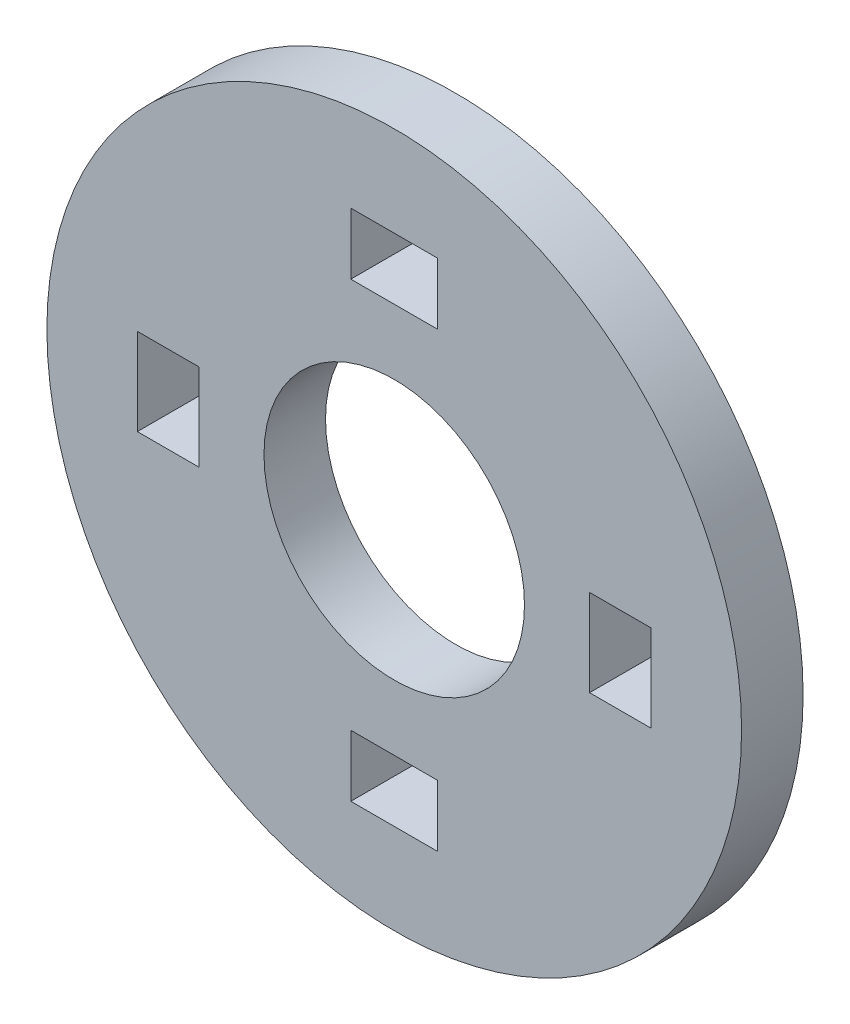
ISO-10303-21;
HEADER;
FILE_DESCRIPTION(('STEP AP214'),'2;1');
FILE_NAME('part.step','',(''),(''),'','','');
FILE_SCHEMA(('AUTOMOTIVE_DESIGN { 1 0 10303 214 1 1 1 1 }'));
ENDSEC;
DATA;
#1=APPLICATION_CONTEXT('core data for automotive mechanical design processes');
#2=APPLICATION_PROTOCOL_DEFINITION('international standard','automotive_design',2000,#1);
#3=PRODUCT_CONTEXT('',#1,'mechanical');
#4=PRODUCT('Part','Part','',(#3));
#5=PRODUCT_RELATED_PRODUCT_CATEGORY('part','',(#4));
#6=PRODUCT_DEFINITION_FORMATION('','',#4);
#7=PRODUCT_DEFINITION_CONTEXT('part definition',#1,'design');
#8=PRODUCT_DEFINITION('design','',#6,#7);
#9=PRODUCT_DEFINITION_SHAPE('','',#8);
#10=(LENGTH_UNIT() NAMED_UNIT(*) SI_UNIT(.MILLI.,.METRE.));
#11=(NAMED_UNIT(*) PLANE_ANGLE_UNIT() SI_UNIT($,.RADIAN.));
#12=(NAMED_UNIT(*) SI_UNIT($,.STERADIAN.) SOLID_ANGLE_UNIT());
#13=UNCERTAINTY_MEASURE_WITH_UNIT(LENGTH_MEASURE(1.E-05),#10,'distance_accuracy_value','');
#14=(GEOMETRIC_REPRESENTATION_CONTEXT(3) GLOBAL_UNCERTAINTY_ASSIGNED_CONTEXT((#13)) GLOBAL_UNIT_ASSIGNED_CONTEXT((#10,
#11,#12)) REPRESENTATION_CONTEXT('',''));
#15=CARTESIAN_POINT('',(0.,0.,0.));
#16=DIRECTION('',(0.,0.,1.));
#17=DIRECTION('',(1.,0.,0.));
#18=AXIS2_PLACEMENT_3D('',#15,#16,#17);
#19=CARTESIAN_POINT('',(0.,0.,4.5));
#20=DIRECTION('',(0.,0.,1.));
#21=DIRECTION('',(1.,0.,0.));
#22=AXIS2_PLACEMENT_3D('',#19,#20,#21);
#23=PLANE('',#22);
#24=CARTESIAN_POINT('',(0.,0.,4.5));
#25=DIRECTION('',(0.,0.,1.));
#26=DIRECTION('',(1.,0.,0.));
#27=AXIS2_PLACEMENT_3D('',#24,#25,#26);
#28=CIRCLE('',#27,9.525);
#29=CARTESIAN_POINT('',(9.525,0.,4.5));
#30=VERTEX_POINT('',#29);
#31=EDGE_CURVE('E169',#30,#30,#28,.T.);
#32=ORIENTED_EDGE('',*,*,#31,.F.);
#33=EDGE_LOOP('',(#32));
#34=FACE_BOUND('',#33,.T.);
#35=DIRECTION('',(0.,-1.,0.));
#36=VECTOR('',#35,1.);
#37=CARTESIAN_POINT('',(-3.175,0.,4.5));
#38=LINE('',#37,#36);
#39=CARTESIAN_POINT('',(-3.175,18.7835533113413,4.5));
#40=VERTEX_POINT('',#39);
#41=CARTESIAN_POINT('',(-3.175,14.2835533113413,4.5));
#42=VERTEX_POINT('',#41);
#43=EDGE_CURVE('E210',#40,#42,#38,.T.);
#44=ORIENTED_EDGE('',*,*,#43,.F.);
#45=DIRECTION('',(1.,0.,0.));
#46=VECTOR('',#45,1.);
#47=CARTESIAN_POINT('',(0.,18.7835533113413,4.5));
#48=LINE('',#47,#46);
#49=CARTESIAN_POINT('',(3.175,18.7835533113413,4.5));
#50=VERTEX_POINT('',#49);
#51=EDGE_CURVE('E221',#40,#50,#48,.T.);
#52=ORIENTED_EDGE('',*,*,#51,.T.);
#53=DIRECTION('',(0.,-1.,0.));
#54=VECTOR('',#53,1.);
#55=CARTESIAN_POINT('',(3.175,0.,4.5));
#56=LINE('',#55,#54);
#57=CARTESIAN_POINT('',(3.175,14.2835533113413,4.5));
#58=VERTEX_POINT('',#57);
#59=EDGE_CURVE('E234',#50,#58,#56,.T.);
#60=ORIENTED_EDGE('',*,*,#59,.T.);
#61=DIRECTION('',(1.,0.,0.));
#62=VECTOR('',#61,1.);
#63=CARTESIAN_POINT('',(0.,14.2835533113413,4.5));
#64=LINE('',#63,#62);
#65=EDGE_CURVE('E231',#42,#58,#64,.T.);
#66=ORIENTED_EDGE('',*,*,#65,.F.);
#67=EDGE_LOOP('',(#44,#52,#60,#66));
#68=FACE_BOUND('',#67,.T.);
#69=CARTESIAN_POINT('',(0.,0.,4.5));
#70=DIRECTION('',(0.,0.,1.));
#71=DIRECTION('',(1.,0.,0.));
#72=AXIS2_PLACEMENT_3D('',#69,#70,#71);
#73=CIRCLE('',#72,25.4);
#74=CARTESIAN_POINT('',(25.4,0.,4.5));
#75=VERTEX_POINT('',#74);
#76=EDGE_CURVE('E11',#75,#75,#73,.T.);
#77=ORIENTED_EDGE('',*,*,#76,.T.);
#78=EDGE_LOOP('',(#77));
#79=FACE_BOUND('',#78,.T.);
#80=DIRECTION('',(0.,1.,0.));
#81=VECTOR('',#80,1.);
#82=CARTESIAN_POINT('',(-18.7835533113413,2.05255249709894E-13,4.5));
#83=LINE('',#82,#81);
#84=CARTESIAN_POINT('',(-18.7835533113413,-3.17499999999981,4.5));
#85=VERTEX_POINT('',#84);
#86=CARTESIAN_POINT('',(-18.7835533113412,3.17500000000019,4.5));
#87=VERTEX_POINT('',#86);
#88=EDGE_CURVE('E262',#85,#87,#83,.T.);
#89=ORIENTED_EDGE('',*,*,#88,.T.);
#90=DIRECTION('',(1.,0.,0.));
#91=VECTOR('',#90,1.);
#92=CARTESIAN_POINT('',(0.,3.175,4.5));
#93=LINE('',#92,#91);
#94=CARTESIAN_POINT('',(-14.2835533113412,3.17500000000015,4.5));
#95=VERTEX_POINT('',#94);
#96=EDGE_CURVE('E241',#87,#95,#93,.T.);
#97=ORIENTED_EDGE('',*,*,#96,.T.);
#98=DIRECTION('',(0.,1.,0.));
#99=VECTOR('',#98,1.);
#100=CARTESIAN_POINT('',(-14.2835533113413,1.4827788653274E-13,4.5));
#101=LINE('',#100,#99);
#102=CARTESIAN_POINT('',(-14.2835533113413,-3.17499999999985,4.5));
#103=VERTEX_POINT('',#102);
#104=EDGE_CURVE('E251',#103,#95,#101,.T.);
#105=ORIENTED_EDGE('',*,*,#104,.F.);
#106=DIRECTION('',(1.,0.,0.));
#107=VECTOR('',#106,1.);
#108=CARTESIAN_POINT('',(0.,-3.175,4.5));
#109=LINE('',#108,#107);
#110=EDGE_CURVE('E265',#85,#103,#109,.T.);
#111=ORIENTED_EDGE('',*,*,#110,.F.);
#112=EDGE_LOOP('',(#89,#97,#105,#111));
#113=FACE_BOUND('',#112,.T.);
#114=DIRECTION('',(0.,-1.,0.));
#115=VECTOR('',#114,1.);
#116=CARTESIAN_POINT('',(18.7835533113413,0.,4.5));
#117=LINE('',#116,#115);
#118=CARTESIAN_POINT('',(18.7835533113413,3.17499999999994,4.5));
#119=VERTEX_POINT('',#118);
#120=CARTESIAN_POINT('',(18.7835533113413,-3.17500000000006,4.5));
#121=VERTEX_POINT('',#120);
#122=EDGE_CURVE('E200',#119,#121,#117,.T.);
#123=ORIENTED_EDGE('',*,*,#122,.T.);
#124=DIRECTION('',(-1.,0.,0.));
#125=VECTOR('',#124,1.);
#126=CARTESIAN_POINT('',(0.,-3.175,4.5));
#127=LINE('',#126,#125);
#128=CARTESIAN_POINT('',(14.2835533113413,-3.17500000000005,4.5));
#129=VERTEX_POINT('',#128);
#130=EDGE_CURVE('E182',#121,#129,#127,.T.);
#131=ORIENTED_EDGE('',*,*,#130,.T.);
#132=DIRECTION('',(0.,-1.,0.));
#133=VECTOR('',#132,1.);
#134=CARTESIAN_POINT('',(14.2835533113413,0.,4.5));
#135=LINE('',#134,#133);
#136=CARTESIAN_POINT('',(14.2835533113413,3.17499999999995,4.5));
#137=VERTEX_POINT('',#136);
#138=EDGE_CURVE('E189',#137,#129,#135,.T.);
#139=ORIENTED_EDGE('',*,*,#138,.F.);
#140=DIRECTION('',(-1.,0.,0.));
#141=VECTOR('',#140,1.);
#142=CARTESIAN_POINT('',(0.,3.175,4.5));
#143=LINE('',#142,#141);
#144=EDGE_CURVE('E203',#119,#137,#143,.T.);
#145=ORIENTED_EDGE('',*,*,#144,.F.);
#146=EDGE_LOOP('',(#123,#131,#139,#145));
#147=FACE_BOUND('',#146,.T.);
#148=DIRECTION('',(-1.,0.,0.));
#149=VECTOR('',#148,1.);
#150=CARTESIAN_POINT('',(-1.23153149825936E-13,-18.7835533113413,4.5));
#151=LINE('',#150,#149);
#152=CARTESIAN_POINT('',(3.17499999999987,-18.7835533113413,4.5));
#153=VERTEX_POINT('',#152);
#154=CARTESIAN_POINT('',(-3.17500000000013,-18.7835533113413,4.5));
#155=VERTEX_POINT('',#154);
#156=EDGE_CURVE('E175',#153,#155,#151,.T.);
#157=ORIENTED_EDGE('',*,*,#156,.T.);
#158=DIRECTION('',(0.,1.,0.));
#159=VECTOR('',#158,1.);
#160=CARTESIAN_POINT('',(-3.175,0.,4.5));
#161=LINE('',#160,#159);
#162=CARTESIAN_POINT('',(-3.1750000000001,-14.2835533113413,4.5));
#163=VERTEX_POINT('',#162);
#164=EDGE_CURVE('E48',#155,#163,#161,.T.);
#165=ORIENTED_EDGE('',*,*,#164,.T.);
#166=DIRECTION('',(-1.,0.,0.));
#167=VECTOR('',#166,1.);
#168=CARTESIAN_POINT('',(-1.01453290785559E-13,-14.2835533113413,4.5));
#169=LINE('',#168,#167);
#170=CARTESIAN_POINT('',(3.1749999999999,-14.2835533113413,4.5));
#171=VERTEX_POINT('',#170);
#172=EDGE_CURVE('E163',#171,#163,#169,.T.);
#173=ORIENTED_EDGE('',*,*,#172,.F.);
#174=DIRECTION('',(0.,1.,0.));
#175=VECTOR('',#174,1.);
#176=CARTESIAN_POINT('',(3.175,0.,4.5));
#177=LINE('',#176,#175);
#178=EDGE_CURVE('E166',#153,#171,#177,.T.);
#179=ORIENTED_EDGE('',*,*,#178,.F.);
#180=EDGE_LOOP('',(#157,#165,#173,#179));
#181=FACE_BOUND('',#180,.T.);
#182=ADVANCED_FACE('F33',(#34,#68,#79,#113,#147,#181),#23,.T.);
#183=CARTESIAN_POINT('',(0.,0.,0.));
#184=DIRECTION('',(0.,0.,1.));
#185=DIRECTION('',(1.,0.,0.));
#186=AXIS2_PLACEMENT_3D('',#183,#184,#185);
#187=PLANE('',#186);
#188=CARTESIAN_POINT('',(0.,0.,0.));
#189=DIRECTION('',(0.,0.,1.));
#190=DIRECTION('',(1.,0.,0.));
#191=AXIS2_PLACEMENT_3D('',#188,#189,#190);
#192=CIRCLE('',#191,9.525);
#193=CARTESIAN_POINT('',(9.525,0.,0.));
#194=VERTEX_POINT('',#193);
#195=EDGE_CURVE('E176',#194,#194,#192,.T.);
#196=ORIENTED_EDGE('',*,*,#195,.T.);
#197=EDGE_LOOP('',(#196));
#198=FACE_BOUND('',#197,.T.);
#199=DIRECTION('',(-1.,0.,0.));
#200=VECTOR('',#199,1.);
#201=CARTESIAN_POINT('',(0.,-3.175,0.));
#202=LINE('',#201,#200);
#203=CARTESIAN_POINT('',(18.7835533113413,-3.17500000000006,0.));
#204=VERTEX_POINT('',#203);
#205=CARTESIAN_POINT('',(14.2835533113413,-3.17500000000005,0.));
#206=VERTEX_POINT('',#205);
#207=EDGE_CURVE('E186',#204,#206,#202,.T.);
#208=ORIENTED_EDGE('',*,*,#207,.F.);
#209=DIRECTION('',(0.,-1.,0.));
#210=VECTOR('',#209,1.);
#211=CARTESIAN_POINT('',(18.7835533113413,0.,0.));
#212=LINE('',#211,#210);
#213=CARTESIAN_POINT('',(18.7835533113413,3.17499999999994,0.));
#214=VERTEX_POINT('',#213);
#215=EDGE_CURVE('E188',#214,#204,#212,.T.);
#216=ORIENTED_EDGE('',*,*,#215,.F.);
#217=DIRECTION('',(-1.,0.,0.));
#218=VECTOR('',#217,1.);
#219=CARTESIAN_POINT('',(0.,3.175,0.));
#220=LINE('',#219,#218);
#221=CARTESIAN_POINT('',(14.2835533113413,3.17499999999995,0.));
#222=VERTEX_POINT('',#221);
#223=EDGE_CURVE('E191',#214,#222,#220,.T.);
#224=ORIENTED_EDGE('',*,*,#223,.T.);
#225=DIRECTION('',(0.,-1.,0.));
#226=VECTOR('',#225,1.);
#227=CARTESIAN_POINT('',(14.2835533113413,0.,0.));
#228=LINE('',#227,#226);
#229=EDGE_CURVE('E194',#222,#206,#228,.T.);
#230=ORIENTED_EDGE('',*,*,#229,.T.);
#231=EDGE_LOOP('',(#208,#216,#224,#230));
#232=FACE_BOUND('',#231,.T.);
#233=DIRECTION('',(1.,0.,0.));
#234=VECTOR('',#233,1.);
#235=CARTESIAN_POINT('',(0.,18.7835533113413,0.));
#236=LINE('',#235,#234);
#237=CARTESIAN_POINT('',(-3.175,18.7835533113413,0.));
#238=VERTEX_POINT('',#237);
#239=CARTESIAN_POINT('',(3.175,18.7835533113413,0.));
#240=VERTEX_POINT('',#239);
#241=EDGE_CURVE('E227',#238,#240,#236,.T.);
#242=ORIENTED_EDGE('',*,*,#241,.F.);
#243=DIRECTION('',(0.,-1.,0.));
#244=VECTOR('',#243,1.);
#245=CARTESIAN_POINT('',(-3.175,0.,0.));
#246=LINE('',#245,#244);
#247=CARTESIAN_POINT('',(-3.175,14.2835533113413,0.));
#248=VERTEX_POINT('',#247);
#249=EDGE_CURVE('E217',#238,#248,#246,.T.);
#250=ORIENTED_EDGE('',*,*,#249,.T.);
#251=DIRECTION('',(1.,0.,0.));
#252=VECTOR('',#251,1.);
#253=CARTESIAN_POINT('',(0.,14.2835533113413,0.));
#254=LINE('',#253,#252);
#255=CARTESIAN_POINT('',(3.175,14.2835533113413,0.));
#256=VERTEX_POINT('',#255);
#257=EDGE_CURVE('E220',#248,#256,#254,.T.);
#258=ORIENTED_EDGE('',*,*,#257,.T.);
#259=DIRECTION('',(0.,-1.,0.));
#260=VECTOR('',#259,1.);
#261=CARTESIAN_POINT('',(3.175,0.,0.));
#262=LINE('',#261,#260);
#263=EDGE_CURVE('E224',#240,#256,#262,.T.);
#264=ORIENTED_EDGE('',*,*,#263,.F.);
#265=EDGE_LOOP('',(#242,#250,#258,#264));
#266=FACE_BOUND('',#265,.T.);
#267=CARTESIAN_POINT('',(0.,0.,0.));
#268=DIRECTION('',(0.,0.,1.));
#269=DIRECTION('',(1.,0.,0.));
#270=AXIS2_PLACEMENT_3D('',#267,#268,#269);
#271=CIRCLE('',#270,25.4);
#272=CARTESIAN_POINT('',(25.4,0.,0.));
#273=VERTEX_POINT('',#272);
#274=EDGE_CURVE('E37',#273,#273,#271,.T.);
#275=ORIENTED_EDGE('',*,*,#274,.F.);
#276=EDGE_LOOP('',(#275));
#277=FACE_BOUND('',#276,.T.);
#278=DIRECTION('',(1.,0.,0.));
#279=VECTOR('',#278,1.);
#280=CARTESIAN_POINT('',(0.,3.175,0.));
#281=LINE('',#280,#279);
#282=CARTESIAN_POINT('',(-18.7835533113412,3.17500000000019,0.));
#283=VERTEX_POINT('',#282);
#284=CARTESIAN_POINT('',(-14.2835533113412,3.17500000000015,0.));
#285=VERTEX_POINT('',#284);
#286=EDGE_CURVE('E248',#283,#285,#281,.T.);
#287=ORIENTED_EDGE('',*,*,#286,.F.);
#288=DIRECTION('',(0.,1.,0.));
#289=VECTOR('',#288,1.);
#290=CARTESIAN_POINT('',(-18.7835533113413,2.05255249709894E-13,0.));
#291=LINE('',#290,#289);
#292=CARTESIAN_POINT('',(-18.7835533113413,-3.17499999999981,0.));
#293=VERTEX_POINT('',#292);
#294=EDGE_CURVE('E250',#293,#283,#291,.T.);
#295=ORIENTED_EDGE('',*,*,#294,.F.);
#296=DIRECTION('',(1.,0.,0.));
#297=VECTOR('',#296,1.);
#298=CARTESIAN_POINT('',(0.,-3.175,0.));
#299=LINE('',#298,#297);
#300=CARTESIAN_POINT('',(-14.2835533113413,-3.17499999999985,0.));
#301=VERTEX_POINT('',#300);
#302=EDGE_CURVE('E253',#293,#301,#299,.T.);
#303=ORIENTED_EDGE('',*,*,#302,.T.);
#304=DIRECTION('',(0.,1.,0.));
#305=VECTOR('',#304,1.);
#306=CARTESIAN_POINT('',(-14.2835533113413,1.4827788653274E-13,0.));
#307=LINE('',#306,#305);
#308=EDGE_CURVE('E256',#301,#285,#307,.T.);
#309=ORIENTED_EDGE('',*,*,#308,.T.);
#310=EDGE_LOOP('',(#287,#295,#303,#309));
#311=FACE_BOUND('',#310,.T.);
#312=DIRECTION('',(0.,1.,0.));
#313=VECTOR('',#312,1.);
#314=CARTESIAN_POINT('',(-3.175,0.,0.));
#315=LINE('',#314,#313);
#316=CARTESIAN_POINT('',(-3.17500000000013,-18.7835533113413,0.));
#317=VERTEX_POINT('',#316);
#318=CARTESIAN_POINT('',(-3.1750000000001,-14.2835533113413,0.));
#319=VERTEX_POINT('',#318);
#320=EDGE_CURVE('E154',#317,#319,#315,.T.);
#321=ORIENTED_EDGE('',*,*,#320,.F.);
#322=DIRECTION('',(-1.,0.,0.));
#323=VECTOR('',#322,1.);
#324=CARTESIAN_POINT('',(-1.23153149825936E-13,-18.7835533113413,0.));
#325=LINE('',#324,#323);
#326=CARTESIAN_POINT('',(3.17499999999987,-18.7835533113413,0.));
#327=VERTEX_POINT('',#326);
#328=EDGE_CURVE('E146',#327,#317,#325,.T.);
#329=ORIENTED_EDGE('',*,*,#328,.F.);
#330=DIRECTION('',(0.,1.,0.));
#331=VECTOR('',#330,1.);
#332=CARTESIAN_POINT('',(3.175,0.,0.));
#333=LINE('',#332,#331);
#334=CARTESIAN_POINT('',(3.1749999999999,-14.2835533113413,0.));
#335=VERTEX_POINT('',#334);
#336=EDGE_CURVE('E56',#327,#335,#333,.T.);
#337=ORIENTED_EDGE('',*,*,#336,.T.);
#338=DIRECTION('',(-1.,0.,0.));
#339=VECTOR('',#338,1.);
#340=CARTESIAN_POINT('',(-1.01453290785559E-13,-14.2835533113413,0.));
#341=LINE('',#340,#339);
#342=EDGE_CURVE('E158',#335,#319,#341,.T.);
#343=ORIENTED_EDGE('',*,*,#342,.T.);
#344=EDGE_LOOP('',(#321,#329,#337,#343));
#345=FACE_BOUND('',#344,.T.);
#346=ADVANCED_FACE('F161',(#198,#232,#266,#277,#311,#345),#187,.F.);
#347=CARTESIAN_POINT('',(0.,0.,4.5));
#348=DIRECTION('',(0.,0.,-1.));
#349=DIRECTION('',(-1.,0.,0.));
#350=AXIS2_PLACEMENT_3D('',#347,#348,#349);
#351=CYLINDRICAL_SURFACE('',#350,25.4);
#352=ORIENTED_EDGE('',*,*,#76,.F.);
#353=EDGE_LOOP('',(#352));
#354=FACE_BOUND('',#353,.T.);
#355=ORIENTED_EDGE('',*,*,#274,.T.);
#356=EDGE_LOOP('',(#355));
#357=FACE_BOUND('',#356,.T.);
#358=ADVANCED_FACE('F35',(#354,#357),#351,.T.);
#359=CARTESIAN_POINT('',(0.,3.175,0.));
#360=DIRECTION('',(0.,-1.,0.));
#361=DIRECTION('',(1.,0.,0.));
#362=AXIS2_PLACEMENT_3D('',#359,#360,#361);
#363=PLANE('',#362);
#364=ORIENTED_EDGE('',*,*,#96,.F.);
#365=DIRECTION('',(0.,0.,1.));
#366=VECTOR('',#365,1.);
#367=CARTESIAN_POINT('',(-18.7835533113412,3.17500000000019,0.));
#368=LINE('',#367,#366);
#369=EDGE_CURVE('E259',#283,#87,#368,.T.);
#370=ORIENTED_EDGE('',*,*,#369,.F.);
#371=ORIENTED_EDGE('',*,*,#286,.T.);
#372=DIRECTION('',(0.,0.,1.));
#373=VECTOR('',#372,1.);
#374=CARTESIAN_POINT('',(-14.2835533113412,3.17500000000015,0.));
#375=LINE('',#374,#373);
#376=EDGE_CURVE('E270',#285,#95,#375,.T.);
#377=ORIENTED_EDGE('',*,*,#376,.T.);
#378=EDGE_LOOP('',(#364,#370,#371,#377));
#379=FACE_BOUND('',#378,.T.);
#380=ADVANCED_FACE('F294',(#379),#363,.T.);
#381=CARTESIAN_POINT('',(-14.2835533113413,1.4827788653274E-13,0.));
#382=DIRECTION('',(1.,0.,0.));
#383=DIRECTION('',(0.,1.,0.));
#384=AXIS2_PLACEMENT_3D('',#381,#382,#383);
#385=PLANE('',#384);
#386=ORIENTED_EDGE('',*,*,#104,.T.);
#387=ORIENTED_EDGE('',*,*,#376,.F.);
#388=ORIENTED_EDGE('',*,*,#308,.F.);
#389=DIRECTION('',(0.,0.,1.));
#390=VECTOR('',#389,1.);
#391=CARTESIAN_POINT('',(-14.2835533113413,-3.17499999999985,0.));
#392=LINE('',#391,#390);
#393=EDGE_CURVE('E272',#301,#103,#392,.T.);
#394=ORIENTED_EDGE('',*,*,#393,.T.);
#395=EDGE_LOOP('',(#386,#387,#388,#394));
#396=FACE_BOUND('',#395,.T.);
#397=ADVANCED_FACE('F296',(#396),#385,.F.);
#398=CARTESIAN_POINT('',(0.,-3.175,0.));
#399=DIRECTION('',(0.,-1.,0.));
#400=DIRECTION('',(1.,0.,0.));
#401=AXIS2_PLACEMENT_3D('',#398,#399,#400);
#402=PLANE('',#401);
#403=ORIENTED_EDGE('',*,*,#110,.T.);
#404=ORIENTED_EDGE('',*,*,#393,.F.);
#405=ORIENTED_EDGE('',*,*,#302,.F.);
#406=DIRECTION('',(0.,0.,1.));
#407=VECTOR('',#406,1.);
#408=CARTESIAN_POINT('',(-18.7835533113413,-3.17499999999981,0.));
#409=LINE('',#408,#407);
#410=EDGE_CURVE('E274',#293,#85,#409,.T.);
#411=ORIENTED_EDGE('',*,*,#410,.T.);
#412=EDGE_LOOP('',(#403,#404,#405,#411));
#413=FACE_BOUND('',#412,.T.);
#414=ADVANCED_FACE('F290',(#413),#402,.F.);
#415=CARTESIAN_POINT('',(-18.7835533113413,2.05255249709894E-13,0.));
#416=DIRECTION('',(1.,0.,0.));
#417=DIRECTION('',(0.,1.,0.));
#418=AXIS2_PLACEMENT_3D('',#415,#416,#417);
#419=PLANE('',#418);
#420=ORIENTED_EDGE('',*,*,#88,.F.);
#421=ORIENTED_EDGE('',*,*,#410,.F.);
#422=ORIENTED_EDGE('',*,*,#294,.T.);
#423=ORIENTED_EDGE('',*,*,#369,.T.);
#424=EDGE_LOOP('',(#420,#421,#422,#423));
#425=FACE_BOUND('',#424,.T.);
#426=ADVANCED_FACE('F280',(#425),#419,.T.);
#427=CARTESIAN_POINT('',(-3.175,0.,0.));
#428=DIRECTION('',(-1.,0.,0.));
#429=DIRECTION('',(0.,-1.,0.));
#430=AXIS2_PLACEMENT_3D('',#427,#428,#429);
#431=PLANE('',#430);
#432=ORIENTED_EDGE('',*,*,#43,.T.);
#433=DIRECTION('',(0.,0.,1.));
#434=VECTOR('',#433,1.);
#435=CARTESIAN_POINT('',(-3.175,14.2835533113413,0.));
#436=LINE('',#435,#434);
#437=EDGE_CURVE('E229',#248,#42,#436,.T.);
#438=ORIENTED_EDGE('',*,*,#437,.F.);
#439=ORIENTED_EDGE('',*,*,#249,.F.);
#440=DIRECTION('',(0.,0.,1.));
#441=VECTOR('',#440,1.);
#442=CARTESIAN_POINT('',(-3.175,18.7835533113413,0.));
#443=LINE('',#442,#441);
#444=EDGE_CURVE('E239',#238,#40,#443,.T.);
#445=ORIENTED_EDGE('',*,*,#444,.T.);
#446=EDGE_LOOP('',(#432,#438,#439,#445));
#447=FACE_BOUND('',#446,.T.);
#448=ADVANCED_FACE('F318',(#447),#431,.F.);
#449=CARTESIAN_POINT('',(0.,18.7835533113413,0.));
#450=DIRECTION('',(0.,-1.,0.));
#451=DIRECTION('',(0.,0.,-1.));
#452=AXIS2_PLACEMENT_3D('',#449,#450,#451);
#453=PLANE('',#452);
#454=ORIENTED_EDGE('',*,*,#51,.F.);
#455=ORIENTED_EDGE('',*,*,#444,.F.);
#456=ORIENTED_EDGE('',*,*,#241,.T.);
#457=DIRECTION('',(0.,0.,1.));
#458=VECTOR('',#457,1.);
#459=CARTESIAN_POINT('',(3.175,18.7835533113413,0.));
#460=LINE('',#459,#458);
#461=EDGE_CURVE('E242',#240,#50,#460,.T.);
#462=ORIENTED_EDGE('',*,*,#461,.T.);
#463=EDGE_LOOP('',(#454,#455,#456,#462));
#464=FACE_BOUND('',#463,.T.);
#465=ADVANCED_FACE('F322',(#464),#453,.T.);
#466=CARTESIAN_POINT('',(3.175,0.,0.));
#467=DIRECTION('',(-1.,0.,0.));
#468=DIRECTION('',(0.,-1.,0.));
#469=AXIS2_PLACEMENT_3D('',#466,#467,#468);
#470=PLANE('',#469);
#471=ORIENTED_EDGE('',*,*,#59,.F.);
#472=ORIENTED_EDGE('',*,*,#461,.F.);
#473=ORIENTED_EDGE('',*,*,#263,.T.);
#474=DIRECTION('',(0.,0.,1.));
#475=VECTOR('',#474,1.);
#476=CARTESIAN_POINT('',(3.175,14.2835533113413,0.));
#477=LINE('',#476,#475);
#478=EDGE_CURVE('E244',#256,#58,#477,.T.);
#479=ORIENTED_EDGE('',*,*,#478,.T.);
#480=EDGE_LOOP('',(#471,#472,#473,#479));
#481=FACE_BOUND('',#480,.T.);
#482=ADVANCED_FACE('F327',(#481),#470,.T.);
#483=CARTESIAN_POINT('',(0.,14.2835533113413,0.));
#484=DIRECTION('',(0.,-1.,0.));
#485=DIRECTION('',(0.,0.,-1.));
#486=AXIS2_PLACEMENT_3D('',#483,#484,#485);
#487=PLANE('',#486);
#488=ORIENTED_EDGE('',*,*,#65,.T.);
#489=ORIENTED_EDGE('',*,*,#478,.F.);
#490=ORIENTED_EDGE('',*,*,#257,.F.);
#491=ORIENTED_EDGE('',*,*,#437,.T.);
#492=EDGE_LOOP('',(#488,#489,#490,#491));
#493=FACE_BOUND('',#492,.T.);
#494=ADVANCED_FACE('F331',(#493),#487,.F.);
#495=CARTESIAN_POINT('',(0.,-3.175,0.));
#496=DIRECTION('',(0.,1.,0.));
#497=DIRECTION('',(-1.,0.,0.));
#498=AXIS2_PLACEMENT_3D('',#495,#496,#497);
#499=PLANE('',#498);
#500=ORIENTED_EDGE('',*,*,#130,.F.);
#501=DIRECTION('',(0.,0.,1.));
#502=VECTOR('',#501,1.);
#503=CARTESIAN_POINT('',(18.7835533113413,-3.17500000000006,0.));
#504=LINE('',#503,#502);
#505=EDGE_CURVE('E197',#204,#121,#504,.T.);
#506=ORIENTED_EDGE('',*,*,#505,.F.);
#507=ORIENTED_EDGE('',*,*,#207,.T.);
#508=DIRECTION('',(0.,0.,1.));
#509=VECTOR('',#508,1.);
#510=CARTESIAN_POINT('',(14.2835533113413,-3.17500000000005,0.));
#511=LINE('',#510,#509);
#512=EDGE_CURVE('E208',#206,#129,#511,.T.);
#513=ORIENTED_EDGE('',*,*,#512,.T.);
#514=EDGE_LOOP('',(#500,#506,#507,#513));
#515=FACE_BOUND('',#514,.T.);
#516=ADVANCED_FACE('F334',(#515),#499,.T.);
#517=CARTESIAN_POINT('',(14.2835533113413,0.,0.));
#518=DIRECTION('',(-1.,0.,0.));
#519=DIRECTION('',(0.,-1.,0.));
#520=AXIS2_PLACEMENT_3D('',#517,#518,#519);
#521=PLANE('',#520);
#522=ORIENTED_EDGE('',*,*,#138,.T.);
#523=ORIENTED_EDGE('',*,*,#512,.F.);
#524=ORIENTED_EDGE('',*,*,#229,.F.);
#525=DIRECTION('',(0.,0.,1.));
#526=VECTOR('',#525,1.);
#527=CARTESIAN_POINT('',(14.2835533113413,3.17499999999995,0.));
#528=LINE('',#527,#526);
#529=EDGE_CURVE('E211',#222,#137,#528,.T.);
#530=ORIENTED_EDGE('',*,*,#529,.T.);
#531=EDGE_LOOP('',(#522,#523,#524,#530));
#532=FACE_BOUND('',#531,.T.);
#533=ADVANCED_FACE('F341',(#532),#521,.F.);
#534=CARTESIAN_POINT('',(0.,3.175,0.));
#535=DIRECTION('',(0.,1.,0.));
#536=DIRECTION('',(-1.,0.,0.));
#537=AXIS2_PLACEMENT_3D('',#534,#535,#536);
#538=PLANE('',#537);
#539=ORIENTED_EDGE('',*,*,#144,.T.);
#540=ORIENTED_EDGE('',*,*,#529,.F.);
#541=ORIENTED_EDGE('',*,*,#223,.F.);
#542=DIRECTION('',(0.,0.,1.));
#543=VECTOR('',#542,1.);
#544=CARTESIAN_POINT('',(18.7835533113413,3.17499999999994,0.));
#545=LINE('',#544,#543);
#546=EDGE_CURVE('E213',#214,#119,#545,.T.);
#547=ORIENTED_EDGE('',*,*,#546,.T.);
#548=EDGE_LOOP('',(#539,#540,#541,#547));
#549=FACE_BOUND('',#548,.T.);
#550=ADVANCED_FACE('F346',(#549),#538,.F.);
#551=CARTESIAN_POINT('',(18.7835533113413,0.,0.));
#552=DIRECTION('',(-1.,0.,0.));
#553=DIRECTION('',(0.,-1.,0.));
#554=AXIS2_PLACEMENT_3D('',#551,#552,#553);
#555=PLANE('',#554);
#556=ORIENTED_EDGE('',*,*,#122,.F.);
#557=ORIENTED_EDGE('',*,*,#546,.F.);
#558=ORIENTED_EDGE('',*,*,#215,.T.);
#559=ORIENTED_EDGE('',*,*,#505,.T.);
#560=EDGE_LOOP('',(#556,#557,#558,#559));
#561=FACE_BOUND('',#560,.T.);
#562=ADVANCED_FACE('F343',(#561),#555,.T.);
#563=CARTESIAN_POINT('',(-3.175,0.,0.));
#564=DIRECTION('',(1.,0.,0.));
#565=DIRECTION('',(0.,1.,0.));
#566=AXIS2_PLACEMENT_3D('',#563,#564,#565);
#567=PLANE('',#566);
#568=ORIENTED_EDGE('',*,*,#164,.F.);
#569=DIRECTION('',(0.,0.,1.));
#570=VECTOR('',#569,1.);
#571=CARTESIAN_POINT('',(-3.17500000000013,-18.7835533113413,0.));
#572=LINE('',#571,#570);
#573=EDGE_CURVE('E149',#317,#155,#572,.T.);
#574=ORIENTED_EDGE('',*,*,#573,.F.);
#575=ORIENTED_EDGE('',*,*,#320,.T.);
#576=DIRECTION('',(0.,0.,1.));
#577=VECTOR('',#576,1.);
#578=CARTESIAN_POINT('',(-3.1750000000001,-14.2835533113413,0.));
#579=LINE('',#578,#577);
#580=EDGE_CURVE('E180',#319,#163,#579,.T.);
#581=ORIENTED_EDGE('',*,*,#580,.T.);
#582=EDGE_LOOP('',(#568,#574,#575,#581));
#583=FACE_BOUND('',#582,.T.);
#584=ADVANCED_FACE('F156',(#583),#567,.T.);
#585=CARTESIAN_POINT('',(-1.01453290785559E-13,-14.2835533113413,0.));
#586=DIRECTION('',(0.,1.,0.));
#587=DIRECTION('',(-1.,0.,0.));
#588=AXIS2_PLACEMENT_3D('',#585,#586,#587);
#589=PLANE('',#588);
#590=ORIENTED_EDGE('',*,*,#172,.T.);
#591=ORIENTED_EDGE('',*,*,#580,.F.);
#592=ORIENTED_EDGE('',*,*,#342,.F.);
#593=DIRECTION('',(0.,0.,1.));
#594=VECTOR('',#593,1.);
#595=CARTESIAN_POINT('',(3.1749999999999,-14.2835533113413,0.));
#596=LINE('',#595,#594);
#597=EDGE_CURVE('E183',#335,#171,#596,.T.);
#598=ORIENTED_EDGE('',*,*,#597,.T.);
#599=EDGE_LOOP('',(#590,#591,#592,#598));
#600=FACE_BOUND('',#599,.T.);
#601=ADVANCED_FACE('F356',(#600),#589,.F.);
#602=CARTESIAN_POINT('',(3.175,0.,0.));
#603=DIRECTION('',(1.,0.,0.));
#604=DIRECTION('',(0.,1.,0.));
#605=AXIS2_PLACEMENT_3D('',#602,#603,#604);
#606=PLANE('',#605);
#607=ORIENTED_EDGE('',*,*,#178,.T.);
#608=ORIENTED_EDGE('',*,*,#597,.F.);
#609=ORIENTED_EDGE('',*,*,#336,.F.);
#610=DIRECTION('',(0.,0.,1.));
#611=VECTOR('',#610,1.);
#612=CARTESIAN_POINT('',(3.17499999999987,-18.7835533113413,0.));
#613=LINE('',#612,#611);
#614=EDGE_CURVE('E151',#327,#153,#613,.T.);
#615=ORIENTED_EDGE('',*,*,#614,.T.);
#616=EDGE_LOOP('',(#607,#608,#609,#615));
#617=FACE_BOUND('',#616,.T.);
#618=ADVANCED_FACE('F360',(#617),#606,.F.);
#619=CARTESIAN_POINT('',(-1.23153149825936E-13,-18.7835533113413,0.));
#620=DIRECTION('',(0.,1.,0.));
#621=DIRECTION('',(-1.,0.,0.));
#622=AXIS2_PLACEMENT_3D('',#619,#620,#621);
#623=PLANE('',#622);
#624=ORIENTED_EDGE('',*,*,#156,.F.);
#625=ORIENTED_EDGE('',*,*,#614,.F.);
#626=ORIENTED_EDGE('',*,*,#328,.T.);
#627=ORIENTED_EDGE('',*,*,#573,.T.);
#628=EDGE_LOOP('',(#624,#625,#626,#627));
#629=FACE_BOUND('',#628,.T.);
#630=ADVANCED_FACE('F148',(#629),#623,.T.);
#631=CARTESIAN_POINT('',(0.,0.,0.));
#632=DIRECTION('',(0.,0.,1.));
#633=DIRECTION('',(1.,0.,0.));
#634=AXIS2_PLACEMENT_3D('',#631,#632,#633);
#635=CYLINDRICAL_SURFACE('',#634,9.525);
#636=ORIENTED_EDGE('',*,*,#195,.F.);
#637=EDGE_LOOP('',(#636));
#638=FACE_BOUND('',#637,.T.);
#639=ORIENTED_EDGE('',*,*,#31,.T.);
#640=EDGE_LOOP('',(#639));
#641=FACE_BOUND('',#640,.T.);
#642=ADVANCED_FACE('F359',(#638,#641),#635,.F.);
#643=CLOSED_SHELL('',(#182,#346,#358,#380,#397,#414,#426,#448,#465,#482,#494,#516,#533,#550,
#562,#584,#601,#618,#630,#642));
#644=MANIFOLD_SOLID_BREP('B2',#643);
#645=ADVANCED_BREP_SHAPE_REPRESENTATION('',(#18,#644),#14);
#646=SHAPE_DEFINITION_REPRESENTATION(#9,#645);
ENDSEC;
END-ISO-10303-21;
